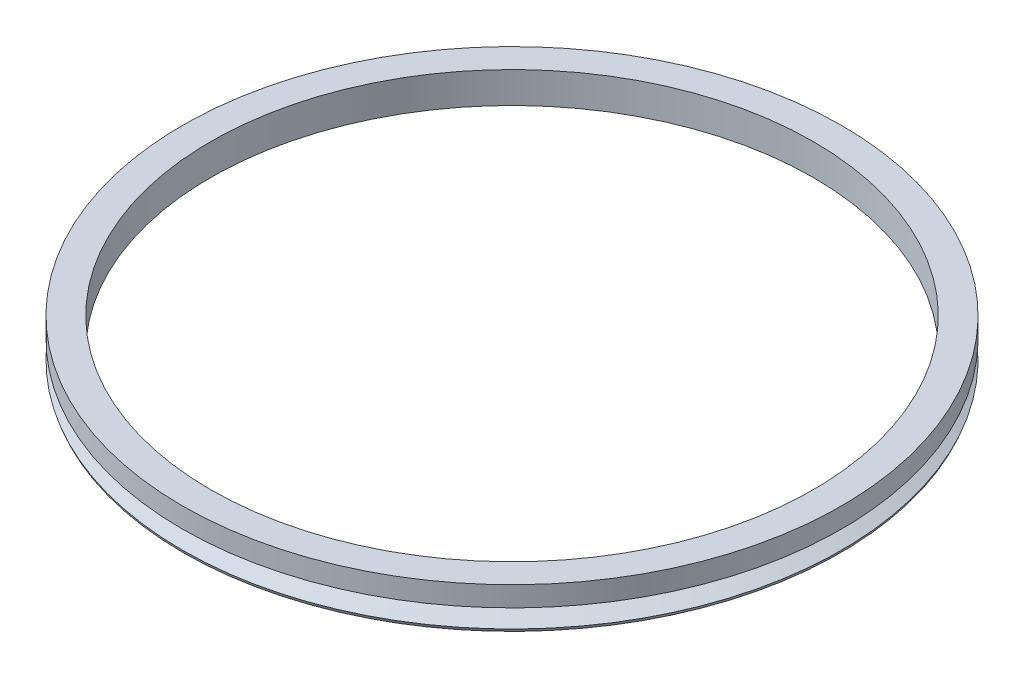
from build123d import *


with BuildPart() as part:
    # Sketch1 → Revolve1 (revolve)
    with BuildSketch(Plane.XY, mode=Mode.PRIVATE) as revolve1_sk:
        Polygon((83.312, 10.414), (76.2, 10.414), (76.2, 2.54), (83.046971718, 0), (83.312, 0.71442565), (78.232, 3.302), (83.312, 5.334), align=None)
    revolve(revolve1_sk.sketch.rotate(Axis((0, 0, 0), (0, 1, 0)), 90), axis=Axis((0, 0, 0), (0, 1, 0)))


solid = part.part
